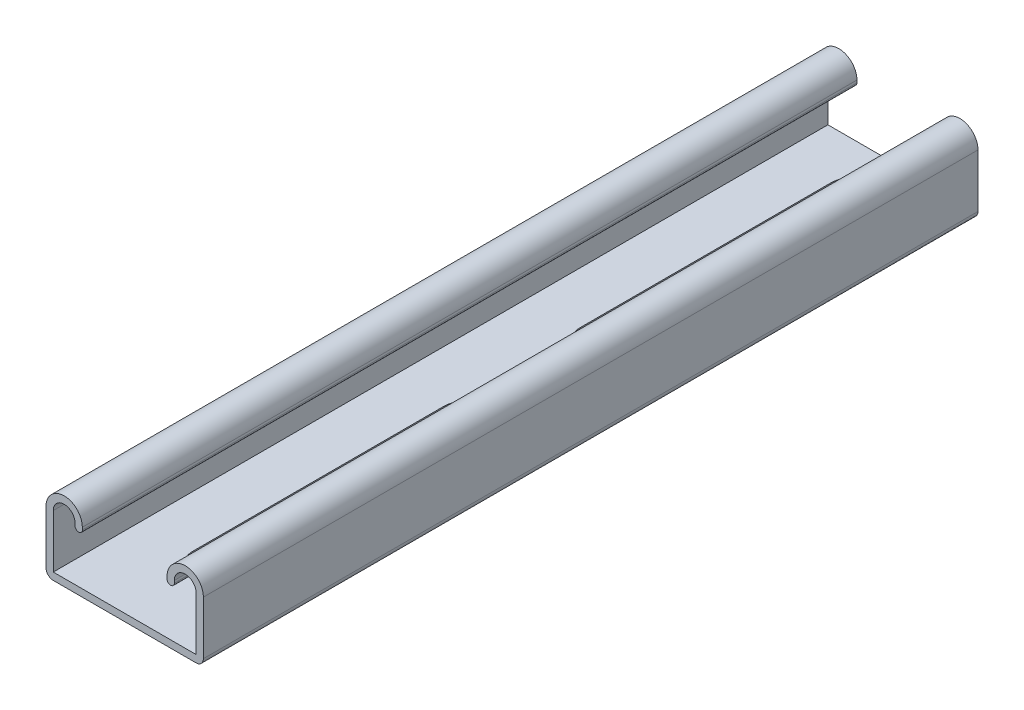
from build123d import *

# Parameters (mm, degrees)
BASE_EXTRUDE_DEPTH = 203.2
SLOT_DEPTH         = 214.573909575
LPATTERN1_COUNT    = 2
LPATTERN1_PITCH    = 101.6


with BuildPart() as part:
    # Sketch1 → Base-Extrude (new body)
    with BuildSketch(Plane.XY):
        with BuildLine():
            Line((-20.6375, 7.4295), (-20.6375, -6.5532))
            ThreePointArc((-20.6375, -6.5532), (-20.079538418, -7.900238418), (-18.7325, -8.4582))
            Line((-18.7325, -8.4582), (18.7325, -8.4582))
            ThreePointArc((18.7325, -8.4582), (20.079538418, -7.900238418), (20.6375, -6.5532))
            Line((20.6375, -6.5532), (20.6375, 7.4295))
            ThreePointArc((20.6375, 7.4295), (15.875, 12.192), (11.1125, 7.4295))
            Line((11.1125, 7.4295), (11.1125, 6.7945))
            ThreePointArc((11.1125, 6.7945), (12.065, 5.842), (13.0175, 6.7945))
            Line((13.0175, 6.7945), (13.0175, 7.4295))
            ThreePointArc((13.0175, 7.4295), (15.875, 10.287), (18.7325, 7.4295))
            Line((18.7325, 7.4295), (18.7325, -6.5532))
            Line((18.7325, -6.5532), (-18.7325, -6.5532))
            Line((-18.7325, -6.5532), (-18.7325, 7.4295))
            ThreePointArc((-18.7325, 7.4295), (-15.875, 10.287), (-13.0175, 7.4295))
            Line((-13.0175, 7.4295), (-13.0175, 6.7945))
            ThreePointArc((-13.0175, 6.7945), (-12.065, 5.842), (-11.1125, 6.7945))
            Line((-11.1125, 6.7945), (-11.1125, 7.4295))
            ThreePointArc((-11.1125, 7.4295), (-15.875, 12.192), (-20.6375, 7.4295))
        make_face()
    extrude(amount=BASE_EXTRUDE_DEPTH)

    # Sketch2 → Slot (cut, through all)
    with BuildSketch(Plane(origin=(-0.560706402, -8.4582, -8.313640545), x_dir=(1, 0, 0), z_dir=(0, -1, 0))):
        with BuildLine():
            Line((5.720081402, 86.894890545), (5.720081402, 21.013640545))
            ThreePointArc((5.720081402, 21.013640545), (0.560706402, 15.854265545), (-4.598668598, 21.013640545))
            Line((-4.598668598, 21.013640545), (-4.598668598, 86.894890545))
            ThreePointArc((-4.598668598, 86.894890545), (0.560706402, 92.054265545), (5.720081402, 86.894890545))
        make_face()
    slot = extrude(amount=-SLOT_DEPTH, mode=Mode.SUBTRACT)

    # LPattern1: Slot ×2
    with Locations(*[(0, 0, i * LPATTERN1_PITCH) for i in range(1, LPATTERN1_COUNT)]):
        add(slot, mode=Mode.SUBTRACT)


solid = part.part
